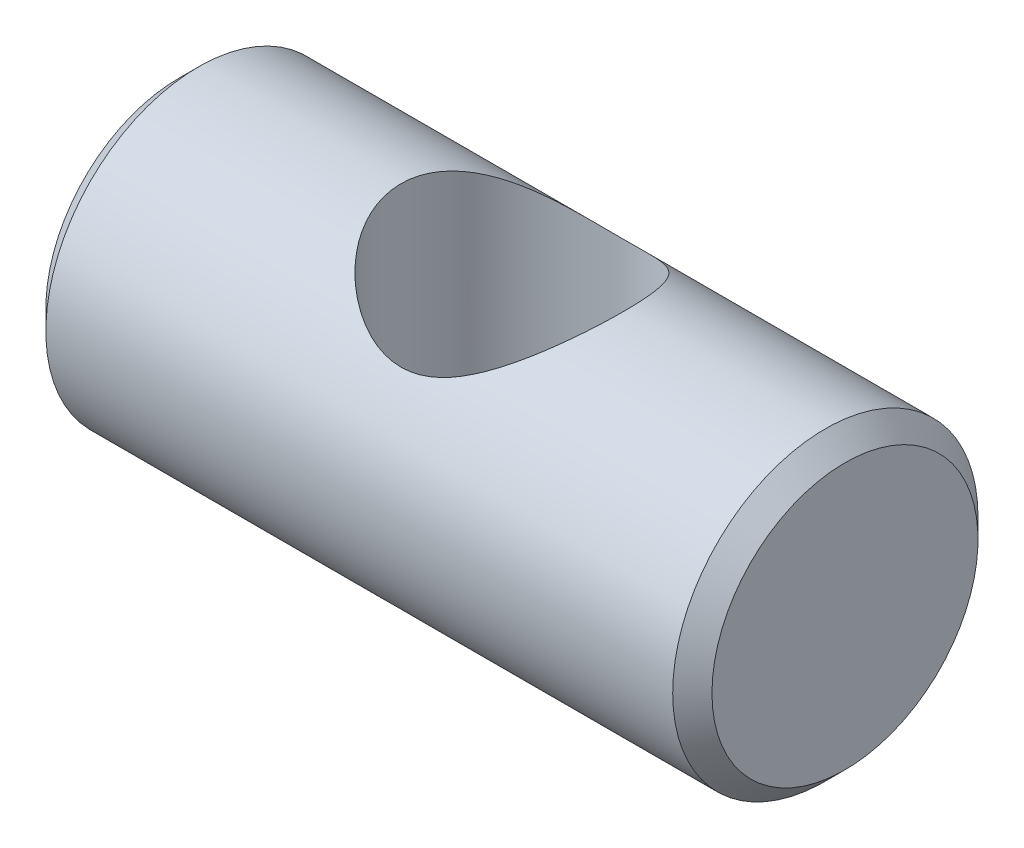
ISO-10303-21;
HEADER;
FILE_DESCRIPTION(('STEP AP214'),'2;1');
FILE_NAME('part.step','',(''),(''),'','','');
FILE_SCHEMA(('AUTOMOTIVE_DESIGN { 1 0 10303 214 1 1 1 1 }'));
ENDSEC;
DATA;
#1=APPLICATION_CONTEXT('core data for automotive mechanical design processes');
#2=APPLICATION_PROTOCOL_DEFINITION('international standard','automotive_design',2000,#1);
#3=PRODUCT_CONTEXT('',#1,'mechanical');
#4=PRODUCT('Part','Part','',(#3));
#5=PRODUCT_RELATED_PRODUCT_CATEGORY('part','',(#4));
#6=PRODUCT_DEFINITION_FORMATION('','',#4);
#7=PRODUCT_DEFINITION_CONTEXT('part definition',#1,'design');
#8=PRODUCT_DEFINITION('design','',#6,#7);
#9=PRODUCT_DEFINITION_SHAPE('','',#8);
#10=(LENGTH_UNIT() NAMED_UNIT(*) SI_UNIT(.MILLI.,.METRE.));
#11=(NAMED_UNIT(*) PLANE_ANGLE_UNIT() SI_UNIT($,.RADIAN.));
#12=(NAMED_UNIT(*) SI_UNIT($,.STERADIAN.) SOLID_ANGLE_UNIT());
#13=UNCERTAINTY_MEASURE_WITH_UNIT(LENGTH_MEASURE(1.E-05),#10,'distance_accuracy_value','');
#14=(GEOMETRIC_REPRESENTATION_CONTEXT(3) GLOBAL_UNCERTAINTY_ASSIGNED_CONTEXT((#13)) GLOBAL_UNIT_ASSIGNED_CONTEXT((#10,
#11,#12)) REPRESENTATION_CONTEXT('',''));
#15=CARTESIAN_POINT('',(0.,0.,0.));
#16=DIRECTION('',(0.,0.,1.));
#17=DIRECTION('',(1.,0.,0.));
#18=AXIS2_PLACEMENT_3D('',#15,#16,#17);
#19=CARTESIAN_POINT('',(12.,4.79289321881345,0.));
#20=DIRECTION('',(-1.,0.,0.));
#21=DIRECTION('',(0.,0.,1.));
#22=AXIS2_PLACEMENT_3D('',#19,#20,#21);
#23=PLANE('',#22);
#24=CARTESIAN_POINT('',(11.9999999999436,0.,0.));
#25=DIRECTION('',(-1.,0.,0.));
#26=DIRECTION('',(0.,0.,1.));
#27=AXIS2_PLACEMENT_3D('',#24,#25,#26);
#28=CIRCLE('',#27,4.79289321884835);
#29=CARTESIAN_POINT('',(11.9999999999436,0.,4.79289321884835));
#30=VERTEX_POINT('',#29);
#31=EDGE_CURVE('E66',#30,#30,#28,.T.);
#32=ORIENTED_EDGE('',*,*,#31,.F.);
#33=EDGE_LOOP('',(#32));
#34=FACE_BOUND('',#33,.T.);
#35=ADVANCED_FACE('F36',(#34),#23,.F.);
#36=CARTESIAN_POINT('',(-12.,0.,0.));
#37=DIRECTION('',(1.,0.,0.));
#38=DIRECTION('',(0.,0.,-1.));
#39=AXIS2_PLACEMENT_3D('',#36,#37,#38);
#40=PLANE('',#39);
#41=CARTESIAN_POINT('',(-12.0000000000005,0.,0.));
#42=DIRECTION('',(1.,0.,0.));
#43=DIRECTION('',(0.,0.,-1.));
#44=AXIS2_PLACEMENT_3D('',#41,#42,#43);
#45=CIRCLE('',#44,4.79289321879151);
#46=CARTESIAN_POINT('',(-12.0000000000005,0.,-4.79289321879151));
#47=VERTEX_POINT('',#46);
#48=EDGE_CURVE('E92',#47,#47,#45,.T.);
#49=ORIENTED_EDGE('',*,*,#48,.F.);
#50=EDGE_LOOP('',(#49));
#51=FACE_BOUND('',#50,.T.);
#52=ADVANCED_FACE('F81',(#51),#40,.F.);
#53=CARTESIAN_POINT('',(11.2928932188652,0.,0.));
#54=DIRECTION('',(-1.,0.,0.));
#55=DIRECTION('',(0.,0.,1.));
#56=AXIS2_PLACEMENT_3D('',#53,#54,#55);
#57=CONICAL_SURFACE('',#56,5.49999999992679,0.785398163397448);
#58=CARTESIAN_POINT('',(11.2928932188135,0.,0.));
#59=DIRECTION('',(1.,0.,0.));
#60=DIRECTION('',(0.,0.,-1.));
#61=AXIS2_PLACEMENT_3D('',#58,#59,#60);
#62=CIRCLE('',#61,5.5);
#63=CARTESIAN_POINT('',(11.2928932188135,0.,-5.5));
#64=VERTEX_POINT('',#63);
#65=EDGE_CURVE('E60',#64,#64,#62,.F.);
#66=ORIENTED_EDGE('',*,*,#65,.F.);
#67=EDGE_LOOP('',(#66));
#68=FACE_BOUND('',#67,.T.);
#69=ORIENTED_EDGE('',*,*,#31,.T.);
#70=EDGE_LOOP('',(#69));
#71=FACE_BOUND('',#70,.T.);
#72=ADVANCED_FACE('F86',(#68,#71),#57,.T.);
#73=CARTESIAN_POINT('',(-11.292893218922,0.,0.));
#74=DIRECTION('',(1.,0.,0.));
#75=DIRECTION('',(0.,0.,-1.));
#76=AXIS2_PLACEMENT_3D('',#73,#74,#75);
#77=CONICAL_SURFACE('',#76,5.49999999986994,0.785398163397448);
#78=ORIENTED_EDGE('',*,*,#48,.T.);
#79=EDGE_LOOP('',(#78));
#80=FACE_BOUND('',#79,.T.);
#81=CARTESIAN_POINT('',(-11.2928932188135,0.,0.));
#82=DIRECTION('',(1.,0.,0.));
#83=DIRECTION('',(0.,0.,-1.));
#84=AXIS2_PLACEMENT_3D('',#81,#82,#83);
#85=CIRCLE('',#84,5.5);
#86=CARTESIAN_POINT('',(-11.2928932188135,0.,-5.5));
#87=VERTEX_POINT('',#86);
#88=EDGE_CURVE('E54',#87,#87,#85,.T.);
#89=ORIENTED_EDGE('',*,*,#88,.F.);
#90=EDGE_LOOP('',(#89));
#91=FACE_BOUND('',#90,.T.);
#92=ADVANCED_FACE('F78',(#80,#91),#77,.T.);
#93=CARTESIAN_POINT('',(12.,0.,0.));
#94=DIRECTION('',(1.,0.,0.));
#95=DIRECTION('',(0.,0.,-1.));
#96=AXIS2_PLACEMENT_3D('',#93,#94,#95);
#97=CYLINDRICAL_SURFACE('',#96,5.5);
#98=CARTESIAN_POINT('',(4.,-5.5,0.));
#99=CARTESIAN_POINT('',(3.99999899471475,-5.49999903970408,0.0984084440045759));
#100=CARTESIAN_POINT('',(3.99636152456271,-5.49735205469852,0.196846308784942));
#101=CARTESIAN_POINT('',(3.98186763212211,-5.48682476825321,0.392949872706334));
#102=CARTESIAN_POINT('',(3.97100665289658,-5.47894116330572,0.490615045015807));
#103=CARTESIAN_POINT('',(3.94220851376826,-5.45810479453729,0.684555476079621));
#104=CARTESIAN_POINT('',(3.92425716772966,-5.44514186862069,0.780827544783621));
#105=CARTESIAN_POINT('',(3.88155959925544,-5.41445183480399,0.971092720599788));
#106=CARTESIAN_POINT('',(3.85681035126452,-5.39672260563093,1.0650847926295));
#107=CARTESIAN_POINT('',(3.77322101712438,-5.33719436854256,1.34149727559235));
#108=CARTESIAN_POINT('',(3.7048263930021,-5.28889729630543,1.51974308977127));
#109=CARTESIAN_POINT('',(3.54570801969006,-5.17868357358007,1.86104833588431));
#110=CARTESIAN_POINT('',(3.45499170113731,-5.11677145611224,2.02411279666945));
#111=CARTESIAN_POINT('',(3.24498611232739,-4.97726899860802,2.34745196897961));
#112=CARTESIAN_POINT('',(3.12384867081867,-4.89876490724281,2.50612448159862));
#113=CARTESIAN_POINT('',(2.86114554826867,-4.735556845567,2.80234464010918));
#114=CARTESIAN_POINT('',(2.71954756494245,-4.65084317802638,2.93985815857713));
#115=CARTESIAN_POINT('',(2.47894022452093,-4.51549142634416,3.14142944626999));
#116=CARTESIAN_POINT('',(2.38584323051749,-4.46491683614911,3.21271520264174));
#117=CARTESIAN_POINT('',(2.1932384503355,-4.36503158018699,3.34716368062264));
#118=CARTESIAN_POINT('',(2.0937288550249,-4.31572127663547,3.41032409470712));
#119=CARTESIAN_POINT('',(1.8885986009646,-4.22002309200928,3.52805237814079));
#120=CARTESIAN_POINT('',(1.78298638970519,-4.17363134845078,3.58263175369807));
#121=CARTESIAN_POINT('',(1.56573311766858,-4.08554066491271,3.68277103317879));
#122=CARTESIAN_POINT('',(1.45409308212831,-4.04384093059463,3.72833246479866));
#123=CARTESIAN_POINT('',(1.18594942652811,-3.95419172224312,3.82361059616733));
#124=CARTESIAN_POINT('',(1.02708689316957,-3.90893007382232,3.86948259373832));
#125=CARTESIAN_POINT('',(0.782796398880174,-3.85440723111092,3.92354368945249));
#126=CARTESIAN_POINT('',(0.700413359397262,-3.83846627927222,3.93910176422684));
#127=CARTESIAN_POINT('',(0.534038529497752,-3.81162335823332,3.96508247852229));
#128=CARTESIAN_POINT('',(0.450047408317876,-3.80071933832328,3.97550720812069));
#129=CARTESIAN_POINT('',(0.280389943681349,-3.78436723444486,3.99107685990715));
#130=CARTESIAN_POINT('',(0.194715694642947,-3.77896160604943,3.99618070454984));
#131=CARTESIAN_POINT('',(0.0230469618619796,-3.77401268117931,4.00085496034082));
#132=CARTESIAN_POINT('',(-0.062947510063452,-3.77446917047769,4.00042557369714));
#133=CARTESIAN_POINT('',(-0.234534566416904,-3.78122375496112,3.9940415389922));
#134=CARTESIAN_POINT('',(-0.320126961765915,-3.78752436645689,3.98808451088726));
#135=CARTESIAN_POINT('',(-0.490201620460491,-3.80567208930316,3.97077015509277));
#136=CARTESIAN_POINT('',(-0.574683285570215,-3.81752207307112,3.95941003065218));
#137=CARTESIAN_POINT('',(-0.751501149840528,-3.847898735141,3.9299073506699));
#138=CARTESIAN_POINT('',(-0.84362776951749,-3.86703500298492,3.91113665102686));
#139=CARTESIAN_POINT('',(-1.02516088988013,-3.91064916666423,3.86752833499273));
#140=CARTESIAN_POINT('',(-1.1145655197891,-3.93513064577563,3.84268664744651));
#141=CARTESIAN_POINT('',(-1.37835251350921,-4.01518937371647,3.75954096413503));
#142=CARTESIAN_POINT('',(-1.54812080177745,-4.07734524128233,3.69264874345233));
#143=CARTESIAN_POINT('',(-1.81959122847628,-4.18940076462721,3.5642123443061));
#144=CARTESIAN_POINT('',(-1.92521790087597,-4.23654386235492,3.50823146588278));
#145=CARTESIAN_POINT('',(-2.13020845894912,-4.33354849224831,3.38767435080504));
#146=CARTESIAN_POINT('',(-2.22957064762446,-4.38341075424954,3.32309579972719));
#147=CARTESIAN_POINT('',(-2.42189227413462,-4.48428947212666,3.18565928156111));
#148=CARTESIAN_POINT('',(-2.51484622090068,-4.53530686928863,3.11279435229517));
#149=CARTESIAN_POINT('',(-2.69405037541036,-4.63707579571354,2.95905843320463));
#150=CARTESIAN_POINT('',(-2.78030031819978,-4.68782731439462,2.87818712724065));
#151=CARTESIAN_POINT('',(-2.94678613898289,-4.78843347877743,2.70755212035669));
#152=CARTESIAN_POINT('',(-3.0269315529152,-4.83826850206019,2.61768838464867));
#153=CARTESIAN_POINT('',(-3.17943947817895,-4.93511583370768,2.43017835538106));
#154=CARTESIAN_POINT('',(-3.25180303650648,-4.98212852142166,2.33253311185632));
#155=CARTESIAN_POINT('',(-3.38795931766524,-5.07204693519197,2.12992764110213));
#156=CARTESIAN_POINT('',(-3.45176745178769,-5.11496000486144,2.02498109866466));
#157=CARTESIAN_POINT('',(-3.57012808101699,-5.19556941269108,1.80816162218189));
#158=CARTESIAN_POINT('',(-3.62468405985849,-5.23326771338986,1.69629131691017));
#159=CARTESIAN_POINT('',(-3.74778284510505,-5.31912327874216,1.41021717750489));
#160=CARTESIAN_POINT('',(-3.81023559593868,-5.36345823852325,1.2321446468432));
#161=CARTESIAN_POINT('',(-3.90978556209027,-5.43463079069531,0.865776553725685));
#162=CARTESIAN_POINT('',(-3.94690145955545,-5.46148127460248,0.67748863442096));
#163=CARTESIAN_POINT('',(-3.99376924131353,-5.4954458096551,0.295007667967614));
#164=CARTESIAN_POINT('',(-4.00342107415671,-5.50248769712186,0.100795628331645));
#165=CARTESIAN_POINT('',(-3.99442043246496,-5.49594258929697,-0.286621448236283));
#166=CARTESIAN_POINT('',(-3.97576673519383,-5.48235470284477,-0.479826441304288));
#167=CARTESIAN_POINT('',(-3.91319900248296,-5.43715890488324,-0.848454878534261));
#168=CARTESIAN_POINT('',(-3.87076622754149,-5.40660857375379,-1.02426702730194));
#169=CARTESIAN_POINT('',(-3.76391863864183,-5.33063562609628,-1.36562564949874));
#170=CARTESIAN_POINT('',(-3.69949926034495,-5.2852099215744,-1.53116998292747));
#171=CARTESIAN_POINT('',(-3.54500864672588,-5.17819647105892,-1.86254817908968));
#172=CARTESIAN_POINT('',(-3.45324469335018,-5.11557595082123,-2.02725211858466));
#173=CARTESIAN_POINT('',(-3.24986864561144,-4.98054847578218,-2.33947109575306));
#174=CARTESIAN_POINT('',(-3.13824329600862,-4.90813499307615,-2.48697454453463));
#175=CARTESIAN_POINT('',(-2.87547207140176,-4.74403863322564,-2.78904311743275));
#176=CARTESIAN_POINT('',(-2.72083192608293,-4.65125321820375,-2.9399691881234));
#177=CARTESIAN_POINT('',(-2.38933728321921,-4.46542541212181,-3.2152051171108));
#178=CARTESIAN_POINT('',(-2.21246506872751,-4.37238287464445,-3.33949353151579));
#179=CARTESIAN_POINT('',(-1.86022272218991,-4.20586816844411,-3.54628148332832));
#180=CARTESIAN_POINT('',(-1.68723359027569,-4.13138834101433,-3.63201008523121));
#181=CARTESIAN_POINT('',(-1.32574742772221,-3.99745252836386,-3.77892413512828));
#182=CARTESIAN_POINT('',(-1.13728383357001,-3.93796522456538,-3.84016090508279));
#183=CARTESIAN_POINT('',(-0.789453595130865,-3.85373689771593,-3.92447442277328));
#184=CARTESIAN_POINT('',(-0.632566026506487,-3.82427115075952,-3.95293016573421));
#185=CARTESIAN_POINT('',(-0.314189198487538,-3.78469363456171,-3.99085072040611));
#186=CARTESIAN_POINT('',(-0.152706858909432,-3.77455417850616,-4.00034270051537));
#187=CARTESIAN_POINT('',(0.170405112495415,-3.77530099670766,-3.9996377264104));
#188=CARTESIAN_POINT('',(0.332034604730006,-3.786218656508,-3.98941138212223));
#189=CARTESIAN_POINT('',(0.650555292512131,-3.82728792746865,-3.95001664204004));
#190=CARTESIAN_POINT('',(0.807438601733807,-3.85746988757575,-3.92081835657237));
#191=CARTESIAN_POINT('',(1.15974890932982,-3.94430870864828,-3.83369579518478));
#192=CARTESIAN_POINT('',(1.35235018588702,-4.00623096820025,-3.76972865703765));
#193=CARTESIAN_POINT('',(1.72116198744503,-4.14523984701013,-3.61630704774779));
#194=CARTESIAN_POINT('',(1.89734420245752,-4.22235196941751,-3.5268095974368));
#195=CARTESIAN_POINT('',(2.23742741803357,-4.38556998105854,-3.32181769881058));
#196=CARTESIAN_POINT('',(2.4008161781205,-4.47187341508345,-3.20563731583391));
#197=CARTESIAN_POINT('',(2.70864188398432,-4.64440662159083,-2.95012732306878));
#198=CARTESIAN_POINT('',(2.8530709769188,-4.73063634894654,-2.81078817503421));
#199=CARTESIAN_POINT('',(3.06853788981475,-4.86434742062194,-2.56887263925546));
#200=CARTESIAN_POINT('',(3.1462007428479,-4.91380339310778,-2.47320695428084));
#201=CARTESIAN_POINT('',(3.29313709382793,-5.00915341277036,-2.27388986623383));
#202=CARTESIAN_POINT('',(3.36240870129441,-5.05504665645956,-2.17023667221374));
#203=CARTESIAN_POINT('',(3.49166326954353,-5.14192851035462,-1.95549931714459));
#204=CARTESIAN_POINT('',(3.55165540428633,-5.18292195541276,-1.8444226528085));
#205=CARTESIAN_POINT('',(3.66149903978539,-5.25880189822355,-1.61540436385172));
#206=CARTESIAN_POINT('',(3.71135581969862,-5.29369157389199,-1.49746635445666));
#207=CARTESIAN_POINT('',(3.78737372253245,-5.34730754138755,-1.29007572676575));
#208=CARTESIAN_POINT('',(3.81624110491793,-5.36780854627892,-1.20206275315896));
#209=CARTESIAN_POINT('',(3.86796791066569,-5.40470593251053,-1.02345557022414));
#210=CARTESIAN_POINT('',(3.89082875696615,-5.42110328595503,-0.932861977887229));
#211=CARTESIAN_POINT('',(3.93019600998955,-5.44942698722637,-0.749865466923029));
#212=CARTESIAN_POINT('',(3.94671849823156,-5.46136464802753,-0.657467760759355));
#213=CARTESIAN_POINT('',(3.97324948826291,-5.48056812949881,-0.471295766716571));
#214=CARTESIAN_POINT('',(3.98326153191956,-5.48783649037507,-0.377522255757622));
#215=CARTESIAN_POINT('',(3.9932941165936,-5.49512453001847,-0.236296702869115));
#216=CARTESIAN_POINT('',(3.99580740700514,-5.49695146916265,-0.189097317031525));
#217=CARTESIAN_POINT('',(3.99916071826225,-5.4993895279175,-0.094600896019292));
#218=CARTESIAN_POINT('',(4.00000048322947,-5.50000046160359,-0.047303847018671));
#219=CARTESIAN_POINT('',(4.,-5.5,0.));
#220=B_SPLINE_CURVE_WITH_KNOTS('',3,(#98,#99,#100,#101,#102,#103,#104,#105,#106,#107,#108,#109,
#110,#111,#112,#113,#114,#115,#116,#117,#118,#119,#120,#121,#122,#123,#124,#125,#126,#127,#128,
#129,#130,#131,#132,#133,#134,#135,#136,#137,#138,#139,#140,#141,#142,#143,#144,#145,#146,#147,
#148,#149,#150,#151,#152,#153,#154,#155,#156,#157,#158,#159,#160,#161,#162,#163,#164,#165,#166,
#167,#168,#169,#170,#171,#172,#173,#174,#175,#176,#177,#178,#179,#180,#181,#182,#183,#184,#185,
#186,#187,#188,#189,#190,#191,#192,#193,#194,#195,#196,#197,#198,#199,#200,#201,#202,#203,#204,
#205,#206,#207,#208,#209,#210,#211,#212,#213,#214,#215,#216,#217,#218,#219),.UNSPECIFIED.,.T.,
.F.,(4,2,2,2,2,2,2,2,2,2,2,2,2,2,2,2,2,2,2,2,2,2,2,2,2,2,2,2,2,2,2,2,2,2,2,2,2,2,2,2,2,2,2,2,2,
2,2,2,2,2,2,2,2,2,2,2,2,2,2,2,4),(0.,0.295173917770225,0.590534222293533,0.886488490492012,
1.18257469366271,1.77055979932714,2.35834943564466,2.99959161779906,3.64185745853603,
4.02458431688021,4.40741962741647,4.78973713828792,5.1719898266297,5.68407429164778,
5.9398376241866,6.19549673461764,6.45311525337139,6.71072435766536,6.96844443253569,
7.22629805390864,7.51370613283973,7.80130747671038,8.37708279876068,8.76220665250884,
9.14743438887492,9.53298821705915,9.91855727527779,10.3090312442,10.6994526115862,
11.0891609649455,11.4787222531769,12.0576277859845,12.6361059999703,13.2166889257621,
13.7972969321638,14.3452171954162,14.8932512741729,15.4870438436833,16.0812341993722,
16.7840549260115,17.4874393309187,18.1061725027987,18.7236022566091,19.2080094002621,
19.6917220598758,20.1761562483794,20.6613555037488,21.2944341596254,21.9285849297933,
22.5813485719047,23.2343817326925,23.6322360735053,24.0301798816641,24.4277277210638,
24.8250679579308,25.1093874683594,25.3936395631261,25.6771656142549,25.9605372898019,
26.1024024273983,26.244289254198),.UNSPECIFIED.);
#221=CARTESIAN_POINT('',(4.,-5.5,0.));
#222=VERTEX_POINT('',#221);
#223=EDGE_CURVE('E10',#222,#222,#220,.T.);
#224=ORIENTED_EDGE('',*,*,#223,.F.);
#225=EDGE_LOOP('',(#224));
#226=FACE_BOUND('',#225,.T.);
#227=CARTESIAN_POINT('',(0.,3.77491721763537,4.));
#228=CARTESIAN_POINT('',(0.0945596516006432,3.77491776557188,3.99999971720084));
#229=CARTESIAN_POINT('',(0.189122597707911,3.77848849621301,3.99663873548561));
#230=CARTESIAN_POINT('',(0.377297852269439,3.79256375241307,3.98328406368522));
#231=CARTESIAN_POINT('',(0.470909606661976,3.80307210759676,3.97328671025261));
#232=CARTESIAN_POINT('',(0.656483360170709,3.83047325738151,3.94687649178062));
#233=CARTESIAN_POINT('',(0.748441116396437,3.84738053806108,3.93044906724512));
#234=CARTESIAN_POINT('',(0.929870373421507,3.88674704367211,3.89152450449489));
#235=CARTESIAN_POINT('',(1.01934036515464,3.90920956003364,3.86902376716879));
#236=CARTESIAN_POINT('',(1.28093397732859,3.98284505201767,3.79365509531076));
#237=CARTESIAN_POINT('',(1.44885844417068,4.04070094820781,3.73252985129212));
#238=CARTESIAN_POINT('',(1.7714629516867,4.16725067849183,3.590688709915));
#239=CARTESIAN_POINT('',(1.92614400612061,4.23594368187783,3.50997431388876));
#240=CARTESIAN_POINT('',(2.25065582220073,4.39220950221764,3.31318173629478));
#241=CARTESIAN_POINT('',(2.41764951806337,4.48086750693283,3.19328494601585));
#242=CARTESIAN_POINT('',(2.73178094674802,4.65787607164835,2.92908108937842));
#243=CARTESIAN_POINT('',(2.87889125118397,4.74622604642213,2.78474090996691));
#244=CARTESIAN_POINT('',(3.09553636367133,4.88143539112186,2.5362822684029));
#245=CARTESIAN_POINT('',(3.17231415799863,4.9305740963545,2.43963284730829));
#246=CARTESIAN_POINT('',(3.31733570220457,5.02510545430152,2.23844845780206));
#247=CARTESIAN_POINT('',(3.38558334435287,5.07049981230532,2.13391712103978));
#248=CARTESIAN_POINT('',(3.51266692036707,5.15622286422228,1.91752007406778));
#249=CARTESIAN_POINT('',(3.57151627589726,5.19655876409,1.80566515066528));
#250=CARTESIAN_POINT('',(3.67896799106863,5.27098737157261,1.57523382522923));
#251=CARTESIAN_POINT('',(3.72757531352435,5.30508310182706,1.45666071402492));
#252=CARTESIAN_POINT('',(3.83193503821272,5.37883076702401,1.16188171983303));
#253=CARTESIAN_POINT('',(3.88193864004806,5.41468159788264,0.982606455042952));
#254=CARTESIAN_POINT('',(3.95663720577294,5.4684829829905,0.616370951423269));
#255=CARTESIAN_POINT('',(3.98135342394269,5.48644856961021,0.429417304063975));
#256=CARTESIAN_POINT('',(4.00411402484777,5.50298682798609,0.0525678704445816));
#257=CARTESIAN_POINT('',(4.00209732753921,5.50151508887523,-0.137333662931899));
#258=CARTESIAN_POINT('',(3.97135939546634,5.47919582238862,-0.51380986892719));
#259=CARTESIAN_POINT('',(3.94263129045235,5.45834331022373,-0.700383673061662));
#260=CARTESIAN_POINT('',(3.86136821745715,5.39994417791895,-1.05962164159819));
#261=CARTESIAN_POINT('',(3.80954610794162,5.36289802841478,-1.23253206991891));
#262=CARTESIAN_POINT('',(3.68473335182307,5.27496945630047,-1.56671343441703));
#263=CARTESIAN_POINT('',(3.61173839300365,5.22408421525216,-1.72798199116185));
#264=CARTESIAN_POINT('',(3.43803005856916,5.10544566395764,-2.05370310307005));
#265=CARTESIAN_POINT('',(3.33514439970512,5.03644942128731,-2.2165364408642));
#266=CARTESIAN_POINT('',(3.10940476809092,4.88988998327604,-2.52348319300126));
#267=CARTESIAN_POINT('',(2.98653148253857,4.81231852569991,-2.66757825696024));
#268=CARTESIAN_POINT('',(2.69807007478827,4.63830410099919,-2.9615059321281));
#269=CARTESIAN_POINT('',(2.52879913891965,4.54106850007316,-3.10726104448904));
#270=CARTESIAN_POINT('',(2.16705523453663,4.3499971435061,-3.36953999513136));
#271=CARTESIAN_POINT('',(1.97457895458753,4.25616187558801,-3.48605965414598));
#272=CARTESIAN_POINT('',(1.61165125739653,4.10203228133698,-3.66526169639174));
#273=CARTESIAN_POINT('',(1.44549066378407,4.03887896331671,-3.73414032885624));
#274=CARTESIAN_POINT('',(1.10068331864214,3.92874308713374,-3.84985589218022));
#275=CARTESIAN_POINT('',(0.922065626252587,3.88172431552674,-3.89674227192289));
#276=CARTESIAN_POINT('',(0.585461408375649,3.81709060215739,-3.9599937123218));
#277=CARTESIAN_POINT('',(0.428880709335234,3.79592350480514,-3.98009730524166));
#278=CARTESIAN_POINT('',(0.113064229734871,3.77333697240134,-4.00152507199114));
#279=CARTESIAN_POINT('',(-0.0461691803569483,3.77190076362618,-4.00286519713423));
#280=CARTESIAN_POINT('',(-0.362327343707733,3.78897679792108,-3.98669865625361));
#281=CARTESIAN_POINT('',(-0.519254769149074,3.80746374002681,-3.96921589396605));
#282=CARTESIAN_POINT('',(-0.82717652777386,3.86149165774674,-3.91666535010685));
#283=CARTESIAN_POINT('',(-0.978161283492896,3.89705903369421,-3.88157034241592));
#284=CARTESIAN_POINT('',(-1.33113055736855,3.99784696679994,-3.77812999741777));
#285=CARTESIAN_POINT('',(-1.52906623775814,4.06924236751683,-3.70207893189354));
#286=CARTESIAN_POINT('',(-1.90640842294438,4.22548400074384,-3.522705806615));
#287=CARTESIAN_POINT('',(-2.08577687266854,4.31035698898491,-3.41932922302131));
#288=CARTESIAN_POINT('',(-2.43025180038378,4.48705740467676,-3.18411833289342));
#289=CARTESIAN_POINT('',(-2.5947714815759,4.57901689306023,-3.05152555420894));
#290=CARTESIAN_POINT('',(-2.90173861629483,4.75969946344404,-2.76125147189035));
#291=CARTESIAN_POINT('',(-3.04420434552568,4.84842517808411,-2.6035911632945));
#292=CARTESIAN_POINT('',(-3.2987599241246,5.01226311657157,-2.271539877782));
#293=CARTESIAN_POINT('',(-3.41190835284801,5.08780186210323,-2.09818660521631));
#294=CARTESIAN_POINT('',(-3.56180731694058,5.18990868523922,-1.82330793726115));
#295=CARTESIAN_POINT('',(-3.6084863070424,5.22208942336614,-1.72916099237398));
#296=CARTESIAN_POINT('',(-3.69470582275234,5.28203430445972,-1.53632285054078));
#297=CARTESIAN_POINT('',(-3.73424977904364,5.30980056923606,-1.43763386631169));
#298=CARTESIAN_POINT('',(-3.80598862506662,5.36049441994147,-1.23534308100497));
#299=CARTESIAN_POINT('',(-3.83811376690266,5.38337594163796,-1.13170490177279));
#300=CARTESIAN_POINT('',(-3.89401032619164,5.42336931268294,-0.921160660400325));
#301=CARTESIAN_POINT('',(-3.9177861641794,5.44048421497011,-0.814256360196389));
#302=CARTESIAN_POINT('',(-3.95655048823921,5.46846521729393,-0.598125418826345));
#303=CARTESIAN_POINT('',(-3.9715445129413,5.47933525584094,-0.48890028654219));
#304=CARTESIAN_POINT('',(-3.9924605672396,5.49451442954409,-0.269138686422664));
#305=CARTESIAN_POINT('',(-3.99838404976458,5.49882461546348,-0.158602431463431));
#306=CARTESIAN_POINT('',(-4.00084937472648,5.50061786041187,0.0467313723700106));
#307=CARTESIAN_POINT('',(-3.99861635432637,5.49899247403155,0.141509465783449));
#308=CARTESIAN_POINT('',(-3.98744748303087,5.49087629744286,0.330490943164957));
#309=CARTESIAN_POINT('',(-3.97850957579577,5.4843840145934,0.42469414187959));
#310=CARTESIAN_POINT('',(-3.95406659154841,5.46667824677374,0.611759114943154));
#311=CARTESIAN_POINT('',(-3.93856396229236,5.45546652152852,0.704621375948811));
#312=CARTESIAN_POINT('',(-3.90122128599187,5.4285691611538,0.888415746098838));
#313=CARTESIAN_POINT('',(-3.87937877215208,5.41288178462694,0.979347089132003));
#314=CARTESIAN_POINT('',(-3.80583624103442,5.36033634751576,1.24445933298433));
#315=CARTESIAN_POINT('',(-3.74554675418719,5.31757017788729,1.41518501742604));
#316=CARTESIAN_POINT('',(-3.60438289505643,5.21910224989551,1.74369677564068));
#317=CARTESIAN_POINT('',(-3.5235051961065,5.16339840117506,1.90148075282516));
#318=CARTESIAN_POINT('',(-3.33179335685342,5.03439725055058,2.22228203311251));
#319=CARTESIAN_POINT('',(-3.21841054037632,4.95974698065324,2.38322541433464));
#320=CARTESIAN_POINT('',(-2.97136345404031,4.80310618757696,2.68497920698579));
#321=CARTESIAN_POINT('',(-2.8376718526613,4.72110583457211,2.82576198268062));
#322=CARTESIAN_POINT('',(-2.61000808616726,4.58883329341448,3.03332548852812));
#323=CARTESIAN_POINT('',(-2.5218601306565,4.53915210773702,3.10699576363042));
#324=CARTESIAN_POINT('',(-2.33932240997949,4.44032981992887,3.24665706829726));
#325=CARTESIAN_POINT('',(-2.24493107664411,4.39118885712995,3.31264615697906));
#326=CARTESIAN_POINT('',(-2.05014191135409,4.29487192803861,3.43660180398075));
#327=CARTESIAN_POINT('',(-1.94974758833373,4.24769484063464,3.49457298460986));
#328=CARTESIAN_POINT('',(-1.74306577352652,4.15687954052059,3.6021255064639));
#329=CARTESIAN_POINT('',(-1.63677862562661,4.11324112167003,3.6517073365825));
#330=CARTESIAN_POINT('',(-1.37275858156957,4.01421622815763,3.76078752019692));
#331=CARTESIAN_POINT('',(-1.21205137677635,3.96151667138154,3.81580236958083));
#332=CARTESIAN_POINT('',(-0.963817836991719,3.89520189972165,3.88309107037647));
#333=CARTESIAN_POINT('',(-0.879972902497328,3.87523421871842,3.90296834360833));
#334=CARTESIAN_POINT('',(-0.710192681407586,3.84024545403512,3.93739985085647));
#335=CARTESIAN_POINT('',(-0.62425835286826,3.82522214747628,3.95195647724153));
#336=CARTESIAN_POINT('',(-0.449073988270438,3.80052630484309,3.97571410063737));
#337=CARTESIAN_POINT('',(-0.359792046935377,3.79096825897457,3.98480070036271));
#338=CARTESIAN_POINT('',(-0.180341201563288,3.77816272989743,3.99694447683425));
#339=CARTESIAN_POINT('',(-0.0901720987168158,3.77491669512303,4.00000026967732));
#340=CARTESIAN_POINT('',(0.,3.77491721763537,4.));
#341=B_SPLINE_CURVE_WITH_KNOTS('',3,(#227,#228,#229,#230,#231,#232,#233,#234,#235,#236,#237,
#238,#239,#240,#241,#242,#243,#244,#245,#246,#247,#248,#249,#250,#251,#252,#253,#254,#255,#256,
#257,#258,#259,#260,#261,#262,#263,#264,#265,#266,#267,#268,#269,#270,#271,#272,#273,#274,#275,
#276,#277,#278,#279,#280,#281,#282,#283,#284,#285,#286,#287,#288,#289,#290,#291,#292,#293,#294,
#295,#296,#297,#298,#299,#300,#301,#302,#303,#304,#305,#306,#307,#308,#309,#310,#311,#312,#313,
#314,#315,#316,#317,#318,#319,#320,#321,#322,#323,#324,#325,#326,#327,#328,#329,#330,#331,#332,
#333,#334,#335,#336,#337,#338,#339,#340),.UNSPECIFIED.,.T.,.F.,(4,2,2,2,2,2,2,2,2,2,2,2,2,2,2,2,
2,2,2,2,2,2,2,2,2,2,2,2,2,2,2,2,2,2,2,2,2,2,2,2,2,2,2,2,2,2,2,2,2,2,2,2,2,2,2,2,4),(0.,
0.283560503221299,0.567277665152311,0.851640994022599,1.13617321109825,1.69729774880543,
2.25837929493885,2.92774006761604,3.5980149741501,3.99610080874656,4.39400433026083,
4.79133442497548,5.18847154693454,5.75445889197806,6.31997012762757,6.88677367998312,
7.45372305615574,8.00426875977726,8.5549266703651,9.16646484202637,9.77859745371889,
10.5066073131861,11.2347211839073,11.8047550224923,12.3735009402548,12.8491941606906,
13.3244829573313,13.7991688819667,14.2745908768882,14.94214771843,15.6110467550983,
16.2999460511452,16.9882713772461,17.6463931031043,17.9757519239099,18.3049519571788,
18.6371312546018,18.9691344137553,19.3009279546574,19.6326683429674,19.9167672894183,
20.2009534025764,20.4850336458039,20.7692245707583,21.3249022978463,21.8806698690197,
22.5100347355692,23.1402542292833,23.5154020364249,23.8906444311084,24.2656695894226,
24.6406728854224,25.1720162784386,25.4371121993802,25.7020887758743,25.9724300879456,
26.24283342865),.UNSPECIFIED.);
#342=CARTESIAN_POINT('',(0.,3.77491721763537,4.));
#343=VERTEX_POINT('',#342);
#344=EDGE_CURVE('E48',#343,#343,#341,.T.);
#345=ORIENTED_EDGE('',*,*,#344,.F.);
#346=EDGE_LOOP('',(#345));
#347=FACE_BOUND('',#346,.T.);
#348=ORIENTED_EDGE('',*,*,#88,.T.);
#349=EDGE_LOOP('',(#348));
#350=FACE_BOUND('',#349,.T.);
#351=ORIENTED_EDGE('',*,*,#65,.T.);
#352=EDGE_LOOP('',(#351));
#353=FACE_BOUND('',#352,.T.);
#354=ADVANCED_FACE('F68',(#226,#347,#350,#353),#97,.T.);
#355=CARTESIAN_POINT('',(0.,-5.5,0.));
#356=DIRECTION('',(0.,1.,0.));
#357=DIRECTION('',(0.,0.,1.));
#358=AXIS2_PLACEMENT_3D('',#355,#356,#357);
#359=CYLINDRICAL_SURFACE('',#358,4.);
#360=ORIENTED_EDGE('',*,*,#223,.T.);
#361=EDGE_LOOP('',(#360));
#362=FACE_BOUND('',#361,.T.);
#363=ORIENTED_EDGE('',*,*,#344,.T.);
#364=EDGE_LOOP('',(#363));
#365=FACE_BOUND('',#364,.T.);
#366=ADVANCED_FACE('F71',(#362,#365),#359,.F.);
#367=CLOSED_SHELL('',(#35,#52,#72,#92,#354,#366));
#368=MANIFOLD_SOLID_BREP('B2',#367);
#369=ADVANCED_BREP_SHAPE_REPRESENTATION('',(#18,#368),#14);
#370=SHAPE_DEFINITION_REPRESENTATION(#9,#369);
ENDSEC;
END-ISO-10303-21;
